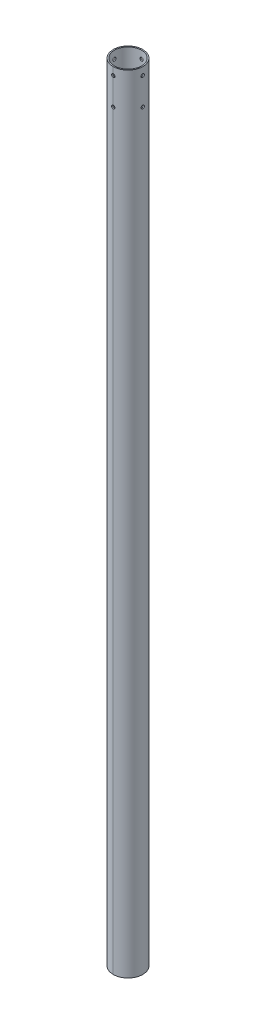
from build123d import *

# Parameters (mm, degrees)
ESQUISSE1_W                            = 3
ESQUISSE1_H                            = 2020
ESQUISSE3_W                            = 4.25
ESQUISSE3_H                            = 38.001
TROU_TARAUD_M101_AT_2_COUNT            = 2
TROU_TARAUD_M101_AT_2_PITCH            = 70
R_P_TITION_CIRCULAIRE1_COUNT           = 4
R_P_TITION_CIRCULAIRE1_COPY_1_SKETCH_W = 4.25
R_P_TITION_CIRCULAIRE1_COPY_1_SKETCH_H = 38.001
R_P_TITION_CIRCULAIRE1_COPY_2_SKETCH_W = 4.25
R_P_TITION_CIRCULAIRE1_COPY_2_SKETCH_H = 38.001
R_P_TITION_CIRCULAIRE1_COPY_3_SKETCH_W = 4.25
R_P_TITION_CIRCULAIRE1_COPY_3_SKETCH_H = 38.001


with BuildPart() as part:
    # Esquisse1 → tube (revolve)
    with BuildSketch(Plane.XY, mode=Mode.PRIVATE) as tube_sk:
        with Locations((36.5, 1990)):
            Rectangle(ESQUISSE1_W, ESQUISSE1_H)
    revolve(tube_sk.sketch.rotate(Axis((0, 3115.539934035, 0), (0, -1, 0)), 180), axis=Axis((0, 3115.539934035, 0), (0, -1, 0)))

    # Esquisse3 → Trou taraud_ M101 (revolve, cut)
    with BuildSketch(Plane(origin=(0, 2980, 0), x_dir=(0, 1, 0), z_dir=(1, 0, 0))):
        with Locations((2.125, 19.0005)):
            Rectangle(ESQUISSE3_W, ESQUISSE3_H)
    trou_taraud_m101 = revolve(axis=Axis((0, 2980, -6.35), (0, 0, 1)), mode=Mode.SUBTRACT)

    # Trou taraud_ M101 at 2: Trou taraud_ M101 ×2
    with Locations(*[(0, -i * TROU_TARAUD_M101_AT_2_PITCH, 0) for i in range(1, TROU_TARAUD_M101_AT_2_COUNT)]):
        add(trou_taraud_m101, mode=Mode.SUBTRACT)

    # R_p_tition circulaire1: Trou taraud_ M101 ×4 about axis
    r_p_tition_circulaire1_axis = Axis((0, 3115.539934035, 0), (0, 1, 0))
    for i in range(1, R_P_TITION_CIRCULAIRE1_COUNT):
        add(trou_taraud_m101.rotate(r_p_tition_circulaire1_axis, i * 360 / R_P_TITION_CIRCULAIRE1_COUNT), mode=Mode.SUBTRACT)

    # R_p_tition circulaire1 copy 1 sketch → R_p_tition circulaire1 copy 1 (revolve, cut)
    with BuildSketch(Plane(origin=(0, 2910, 0), x_dir=(0, 1, 0), z_dir=(0, 0, -1))):
        with Locations((2.125, 19.0005)):
            Rectangle(R_P_TITION_CIRCULAIRE1_COPY_1_SKETCH_W, R_P_TITION_CIRCULAIRE1_COPY_1_SKETCH_H)
    revolve(axis=Axis((-6.35, 2910, 0), (1, 0, 0)), mode=Mode.SUBTRACT)

    # R_p_tition circulaire1 copy 2 sketch → R_p_tition circulaire1 copy 2 (revolve, cut)
    with BuildSketch(Plane(origin=(0, 2910, 0), x_dir=(0, 1, 0), z_dir=(-1, 0, 0))):
        with Locations((2.125, 19.0005)):
            Rectangle(R_P_TITION_CIRCULAIRE1_COPY_2_SKETCH_W, R_P_TITION_CIRCULAIRE1_COPY_2_SKETCH_H)
    revolve(axis=Axis((0, 2910, 6.35), (0, 0, -1)), mode=Mode.SUBTRACT)

    # R_p_tition circulaire1 copy 3 sketch → R_p_tition circulaire1 copy 3 (revolve, cut)
    with BuildSketch(Plane(origin=(0, 2910, 0), x_dir=(0, 1, 0), z_dir=(0, 0, 1))):
        with Locations((2.125, 19.0005)):
            Rectangle(R_P_TITION_CIRCULAIRE1_COPY_3_SKETCH_W, R_P_TITION_CIRCULAIRE1_COPY_3_SKETCH_H)
    revolve(axis=Axis((6.35, 2910, 0), (-1, 0, 0)), mode=Mode.SUBTRACT)


solid = part.part
